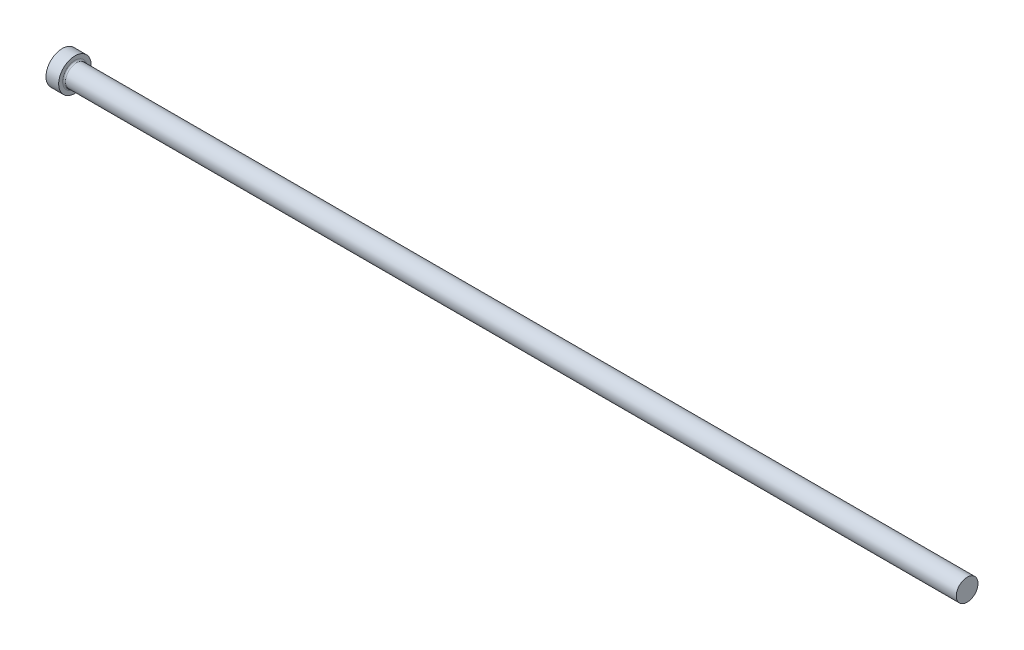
ISO-10303-21;
HEADER;
FILE_DESCRIPTION(('STEP AP214'),'2;1');
FILE_NAME('part.step','',(''),(''),'','','');
FILE_SCHEMA(('AUTOMOTIVE_DESIGN { 1 0 10303 214 1 1 1 1 }'));
ENDSEC;
DATA;
#1=APPLICATION_CONTEXT('core data for automotive mechanical design processes');
#2=APPLICATION_PROTOCOL_DEFINITION('international standard','automotive_design',2000,#1);
#3=PRODUCT_CONTEXT('',#1,'mechanical');
#4=PRODUCT('Part','Part','',(#3));
#5=PRODUCT_RELATED_PRODUCT_CATEGORY('part','',(#4));
#6=PRODUCT_DEFINITION_FORMATION('','',#4);
#7=PRODUCT_DEFINITION_CONTEXT('part definition',#1,'design');
#8=PRODUCT_DEFINITION('design','',#6,#7);
#9=PRODUCT_DEFINITION_SHAPE('','',#8);
#10=(LENGTH_UNIT() NAMED_UNIT(*) SI_UNIT(.MILLI.,.METRE.));
#11=(NAMED_UNIT(*) PLANE_ANGLE_UNIT() SI_UNIT($,.RADIAN.));
#12=(NAMED_UNIT(*) SI_UNIT($,.STERADIAN.) SOLID_ANGLE_UNIT());
#13=UNCERTAINTY_MEASURE_WITH_UNIT(LENGTH_MEASURE(1.E-05),#10,'distance_accuracy_value','');
#14=(GEOMETRIC_REPRESENTATION_CONTEXT(3) GLOBAL_UNCERTAINTY_ASSIGNED_CONTEXT((#13)) GLOBAL_UNIT_ASSIGNED_CONTEXT((#10,
#11,#12)) REPRESENTATION_CONTEXT('',''));
#15=CARTESIAN_POINT('',(0.,0.,0.));
#16=DIRECTION('',(0.,0.,1.));
#17=DIRECTION('',(1.,0.,0.));
#18=AXIS2_PLACEMENT_3D('',#15,#16,#17);
#19=CARTESIAN_POINT('',(0.,0.,0.));
#20=DIRECTION('',(-1.,0.,0.));
#21=DIRECTION('',(0.,-1.,0.));
#22=AXIS2_PLACEMENT_3D('',#19,#20,#21);
#23=PLANE('',#22);
#24=CARTESIAN_POINT('',(0.,0.,0.));
#25=DIRECTION('',(1.,0.,0.));
#26=DIRECTION('',(0.,1.,0.));
#27=AXIS2_PLACEMENT_3D('',#24,#25,#26);
#28=CIRCLE('',#27,9.);
#29=CARTESIAN_POINT('',(0.,9.,0.));
#30=VERTEX_POINT('',#29);
#31=EDGE_CURVE('E29',#30,#30,#28,.T.);
#32=ORIENTED_EDGE('',*,*,#31,.F.);
#33=EDGE_LOOP('',(#32));
#34=FACE_BOUND('',#33,.T.);
#35=ADVANCED_FACE('F14',(#34),#23,.T.);
#36=CARTESIAN_POINT('',(500.,0.,0.));
#37=DIRECTION('',(1.,0.,0.));
#38=DIRECTION('',(0.,1.,0.));
#39=AXIS2_PLACEMENT_3D('',#36,#37,#38);
#40=CYLINDRICAL_SURFACE('',#39,9.);
#41=ORIENTED_EDGE('',*,*,#31,.T.);
#42=EDGE_LOOP('',(#41));
#43=FACE_BOUND('',#42,.T.);
#44=CARTESIAN_POINT('',(7.,0.,0.));
#45=DIRECTION('',(1.,0.,0.));
#46=DIRECTION('',(0.,1.,0.));
#47=AXIS2_PLACEMENT_3D('',#44,#45,#46);
#48=CIRCLE('',#47,9.);
#49=CARTESIAN_POINT('',(7.,9.,0.));
#50=VERTEX_POINT('',#49);
#51=EDGE_CURVE('E34',#50,#50,#48,.T.);
#52=ORIENTED_EDGE('',*,*,#51,.F.);
#53=EDGE_LOOP('',(#52));
#54=FACE_BOUND('',#53,.T.);
#55=ADVANCED_FACE('F55',(#43,#54),#40,.T.);
#56=CARTESIAN_POINT('',(7.,9.,0.));
#57=DIRECTION('',(1.,0.,0.));
#58=DIRECTION('',(0.,1.,0.));
#59=AXIS2_PLACEMENT_3D('',#56,#57,#58);
#60=PLANE('',#59);
#61=CARTESIAN_POINT('',(7.,0.,0.));
#62=DIRECTION('',(1.,0.,0.));
#63=DIRECTION('',(0.,1.,0.));
#64=AXIS2_PLACEMENT_3D('',#61,#62,#63);
#65=CIRCLE('',#64,6.8);
#66=CARTESIAN_POINT('',(7.,6.8,0.));
#67=VERTEX_POINT('',#66);
#68=EDGE_CURVE('E9',#67,#67,#65,.F.);
#69=ORIENTED_EDGE('',*,*,#68,.T.);
#70=EDGE_LOOP('',(#69));
#71=FACE_BOUND('',#70,.T.);
#72=ORIENTED_EDGE('',*,*,#51,.T.);
#73=EDGE_LOOP('',(#72));
#74=FACE_BOUND('',#73,.T.);
#75=ADVANCED_FACE('F48',(#71,#74),#60,.T.);
#76=CARTESIAN_POINT('',(500.,0.,0.));
#77=DIRECTION('',(1.,0.,0.));
#78=DIRECTION('',(0.,1.,0.));
#79=AXIS2_PLACEMENT_3D('',#76,#77,#78);
#80=CYLINDRICAL_SURFACE('',#79,5.99999999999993);
#81=CARTESIAN_POINT('',(7.8,0.,0.));
#82=DIRECTION('',(1.,0.,0.));
#83=DIRECTION('',(0.,1.,0.));
#84=AXIS2_PLACEMENT_3D('',#81,#82,#83);
#85=CIRCLE('',#84,5.99999999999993);
#86=CARTESIAN_POINT('',(7.8,5.99999999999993,0.));
#87=VERTEX_POINT('',#86);
#88=EDGE_CURVE('E22',#87,#87,#85,.T.);
#89=ORIENTED_EDGE('',*,*,#88,.T.);
#90=EDGE_LOOP('',(#89));
#91=FACE_BOUND('',#90,.T.);
#92=CARTESIAN_POINT('',(500.,0.,0.));
#93=DIRECTION('',(1.,0.,0.));
#94=DIRECTION('',(0.,1.,0.));
#95=AXIS2_PLACEMENT_3D('',#92,#93,#94);
#96=CIRCLE('',#95,6.);
#97=CARTESIAN_POINT('',(500.,6.00000000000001,0.));
#98=VERTEX_POINT('',#97);
#99=EDGE_CURVE('E39',#98,#98,#96,.T.);
#100=ORIENTED_EDGE('',*,*,#99,.F.);
#101=EDGE_LOOP('',(#100));
#102=FACE_BOUND('',#101,.T.);
#103=ADVANCED_FACE('F46',(#91,#102),#80,.T.);
#104=CARTESIAN_POINT('',(500.,6.,0.));
#105=DIRECTION('',(1.,0.,0.));
#106=DIRECTION('',(0.,1.,0.));
#107=AXIS2_PLACEMENT_3D('',#104,#105,#106);
#108=PLANE('',#107);
#109=ORIENTED_EDGE('',*,*,#99,.T.);
#110=EDGE_LOOP('',(#109));
#111=FACE_BOUND('',#110,.T.);
#112=ADVANCED_FACE('F44',(#111),#108,.T.);
#113=CARTESIAN_POINT('',(7.8,0.,0.));
#114=DIRECTION('',(1.,0.,0.));
#115=DIRECTION('',(0.,1.,0.));
#116=AXIS2_PLACEMENT_3D('',#113,#114,#115);
#117=TOROIDAL_SURFACE('',#116,6.8,0.8);
#118=ORIENTED_EDGE('',*,*,#68,.F.);
#119=EDGE_LOOP('',(#118));
#120=FACE_BOUND('',#119,.T.);
#121=ORIENTED_EDGE('',*,*,#88,.F.);
#122=EDGE_LOOP('',(#121));
#123=FACE_BOUND('',#122,.T.);
#124=ADVANCED_FACE('F16',(#120,#123),#117,.F.);
#125=CLOSED_SHELL('',(#35,#55,#75,#103,#112,#124));
#126=MANIFOLD_SOLID_BREP('B1',#125);
#127=ADVANCED_BREP_SHAPE_REPRESENTATION('',(#18,#126),#14);
#128=SHAPE_DEFINITION_REPRESENTATION(#9,#127);
ENDSEC;
END-ISO-10303-21;
